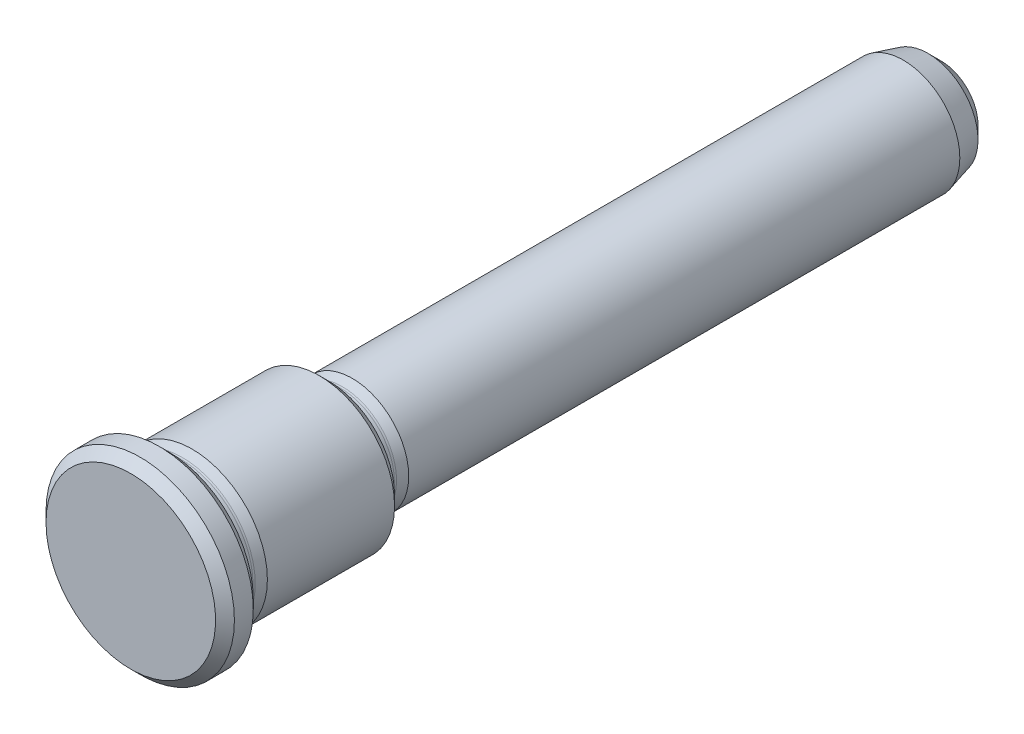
ISO-10303-21;
HEADER;
FILE_DESCRIPTION(('STEP AP214'),'2;1');
FILE_NAME('part.step','',(''),(''),'','','');
FILE_SCHEMA(('AUTOMOTIVE_DESIGN { 1 0 10303 214 1 1 1 1 }'));
ENDSEC;
DATA;
#1=APPLICATION_CONTEXT('core data for automotive mechanical design processes');
#2=APPLICATION_PROTOCOL_DEFINITION('international standard','automotive_design',2000,#1);
#3=PRODUCT_CONTEXT('',#1,'mechanical');
#4=PRODUCT('Part','Part','',(#3));
#5=PRODUCT_RELATED_PRODUCT_CATEGORY('part','',(#4));
#6=PRODUCT_DEFINITION_FORMATION('','',#4);
#7=PRODUCT_DEFINITION_CONTEXT('part definition',#1,'design');
#8=PRODUCT_DEFINITION('design','',#6,#7);
#9=PRODUCT_DEFINITION_SHAPE('','',#8);
#10=(LENGTH_UNIT() NAMED_UNIT(*) SI_UNIT(.MILLI.,.METRE.));
#11=(NAMED_UNIT(*) PLANE_ANGLE_UNIT() SI_UNIT($,.RADIAN.));
#12=(NAMED_UNIT(*) SI_UNIT($,.STERADIAN.) SOLID_ANGLE_UNIT());
#13=UNCERTAINTY_MEASURE_WITH_UNIT(LENGTH_MEASURE(1.E-05),#10,'distance_accuracy_value','');
#14=(GEOMETRIC_REPRESENTATION_CONTEXT(3) GLOBAL_UNCERTAINTY_ASSIGNED_CONTEXT((#13)) GLOBAL_UNIT_ASSIGNED_CONTEXT((#10,
#11,#12)) REPRESENTATION_CONTEXT('',''));
#15=CARTESIAN_POINT('',(0.,0.,0.));
#16=DIRECTION('',(0.,0.,1.));
#17=DIRECTION('',(1.,0.,0.));
#18=AXIS2_PLACEMENT_3D('',#15,#16,#17);
#19=CARTESIAN_POINT('',(0.,0.,0.));
#20=DIRECTION('',(0.,0.,-1.));
#21=DIRECTION('',(-1.,0.,0.));
#22=AXIS2_PLACEMENT_3D('',#19,#20,#21);
#23=PLANE('',#22);
#24=CARTESIAN_POINT('',(0.,0.,0.));
#25=DIRECTION('',(0.,0.,-1.));
#26=DIRECTION('',(-1.,0.,0.));
#27=AXIS2_PLACEMENT_3D('',#24,#25,#26);
#28=CIRCLE('',#27,9.);
#29=CARTESIAN_POINT('',(-9.,0.,0.));
#30=VERTEX_POINT('',#29);
#31=EDGE_CURVE('E8',#30,#30,#28,.F.);
#32=ORIENTED_EDGE('',*,*,#31,.T.);
#33=EDGE_LOOP('',(#32));
#34=FACE_BOUND('',#33,.T.);
#35=ADVANCED_FACE('F13',(#34),#23,.F.);
#36=CARTESIAN_POINT('',(0.,0.,0.));
#37=DIRECTION('',(0.,0.,1.));
#38=DIRECTION('',(1.,0.,0.));
#39=AXIS2_PLACEMENT_3D('',#36,#37,#38);
#40=CYLINDRICAL_SURFACE('',#39,10.);
#41=CARTESIAN_POINT('',(0.,0.,-3.));
#42=DIRECTION('',(0.,0.,1.));
#43=DIRECTION('',(1.,0.,0.));
#44=AXIS2_PLACEMENT_3D('',#41,#42,#43);
#45=CIRCLE('',#44,10.);
#46=CARTESIAN_POINT('',(10.,0.,-3.));
#47=VERTEX_POINT('',#46);
#48=EDGE_CURVE('E24',#47,#47,#45,.T.);
#49=ORIENTED_EDGE('',*,*,#48,.T.);
#50=EDGE_LOOP('',(#49));
#51=FACE_BOUND('',#50,.T.);
#52=CARTESIAN_POINT('',(0.,0.,-1.));
#53=DIRECTION('',(0.,0.,-1.));
#54=DIRECTION('',(-1.,0.,0.));
#55=AXIS2_PLACEMENT_3D('',#52,#53,#54);
#56=CIRCLE('',#55,10.);
#57=CARTESIAN_POINT('',(-10.,0.,-1.));
#58=VERTEX_POINT('',#57);
#59=EDGE_CURVE('E28',#58,#58,#56,.T.);
#60=ORIENTED_EDGE('',*,*,#59,.T.);
#61=EDGE_LOOP('',(#60));
#62=FACE_BOUND('',#61,.T.);
#63=ADVANCED_FACE('F99',(#51,#62),#40,.T.);
#64=CARTESIAN_POINT('',(0.,10.,-4.));
#65=DIRECTION('',(0.,0.,1.));
#66=DIRECTION('',(1.,0.,0.));
#67=AXIS2_PLACEMENT_3D('',#64,#65,#66);
#68=PLANE('',#67);
#69=CARTESIAN_POINT('',(0.,0.,-4.));
#70=DIRECTION('',(0.,0.,1.));
#71=DIRECTION('',(1.,0.,0.));
#72=AXIS2_PLACEMENT_3D('',#69,#70,#71);
#73=CIRCLE('',#72,9.);
#74=CARTESIAN_POINT('',(9.,0.,-4.));
#75=VERTEX_POINT('',#74);
#76=EDGE_CURVE('E20',#75,#75,#73,.F.);
#77=ORIENTED_EDGE('',*,*,#76,.T.);
#78=EDGE_LOOP('',(#77));
#79=FACE_BOUND('',#78,.T.);
#80=CARTESIAN_POINT('',(0.,0.,-4.));
#81=DIRECTION('',(0.,0.,1.));
#82=DIRECTION('',(1.,0.,0.));
#83=AXIS2_PLACEMENT_3D('',#80,#81,#82);
#84=CIRCLE('',#83,8.5);
#85=CARTESIAN_POINT('',(8.5,0.,-4.));
#86=VERTEX_POINT('',#85);
#87=EDGE_CURVE('E45',#86,#86,#84,.T.);
#88=ORIENTED_EDGE('',*,*,#87,.T.);
#89=EDGE_LOOP('',(#88));
#90=FACE_BOUND('',#89,.T.);
#91=ADVANCED_FACE('F105',(#79,#90),#68,.F.);
#92=CARTESIAN_POINT('',(0.,0.,-4.8));
#93=DIRECTION('',(0.,0.,1.));
#94=DIRECTION('',(1.,0.,0.));
#95=AXIS2_PLACEMENT_3D('',#92,#93,#94);
#96=TOROIDAL_SURFACE('',#95,8.5,0.8);
#97=ORIENTED_EDGE('',*,*,#87,.F.);
#98=EDGE_LOOP('',(#97));
#99=FACE_BOUND('',#98,.T.);
#100=CARTESIAN_POINT('',(0.,0.,-4.8));
#101=DIRECTION('',(0.,0.,1.));
#102=DIRECTION('',(1.,0.,0.));
#103=AXIS2_PLACEMENT_3D('',#100,#101,#102);
#104=CIRCLE('',#103,7.7);
#105=CARTESIAN_POINT('',(7.7,0.,-4.8));
#106=VERTEX_POINT('',#105);
#107=EDGE_CURVE('E48',#106,#106,#104,.T.);
#108=ORIENTED_EDGE('',*,*,#107,.T.);
#109=EDGE_LOOP('',(#108));
#110=FACE_BOUND('',#109,.T.);
#111=ADVANCED_FACE('F175',(#99,#110),#96,.F.);
#112=CARTESIAN_POINT('',(0.,0.,0.));
#113=DIRECTION('',(0.,0.,1.));
#114=DIRECTION('',(1.,0.,0.));
#115=AXIS2_PLACEMENT_3D('',#112,#113,#114);
#116=CYLINDRICAL_SURFACE('',#115,7.7);
#117=ORIENTED_EDGE('',*,*,#107,.F.);
#118=EDGE_LOOP('',(#117));
#119=FACE_BOUND('',#118,.T.);
#120=CARTESIAN_POINT('',(0.,0.,-5.27506275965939));
#121=DIRECTION('',(0.,0.,1.));
#122=DIRECTION('',(1.,0.,0.));
#123=AXIS2_PLACEMENT_3D('',#120,#121,#122);
#124=CIRCLE('',#123,7.7);
#125=CARTESIAN_POINT('',(7.7,0.,-5.27506275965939));
#126=VERTEX_POINT('',#125);
#127=EDGE_CURVE('E51',#126,#126,#124,.T.);
#128=ORIENTED_EDGE('',*,*,#127,.T.);
#129=EDGE_LOOP('',(#128));
#130=FACE_BOUND('',#129,.T.);
#131=ADVANCED_FACE('F231',(#119,#130),#116,.T.);
#132=CARTESIAN_POINT('',(0.,0.,-5.27506275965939));
#133=DIRECTION('',(0.,0.,1.));
#134=DIRECTION('',(1.,0.,0.));
#135=AXIS2_PLACEMENT_3D('',#132,#133,#134);
#136=TOROIDAL_SURFACE('',#135,8.5,0.8);
#137=ORIENTED_EDGE('',*,*,#127,.F.);
#138=EDGE_LOOP('',(#137));
#139=FACE_BOUND('',#138,.T.);
#140=CARTESIAN_POINT('',(0.,0.,-5.4821179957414));
#141=DIRECTION('',(0.,0.,1.));
#142=DIRECTION('',(1.,0.,0.));
#143=AXIS2_PLACEMENT_3D('',#140,#141,#142);
#144=CIRCLE('',#143,7.72725933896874);
#145=CARTESIAN_POINT('',(7.72725933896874,0.,-5.4821179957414));
#146=VERTEX_POINT('',#145);
#147=EDGE_CURVE('E54',#146,#146,#144,.T.);
#148=ORIENTED_EDGE('',*,*,#147,.T.);
#149=EDGE_LOOP('',(#148));
#150=FACE_BOUND('',#149,.T.);
#151=ADVANCED_FACE('F221',(#139,#150),#136,.F.);
#152=CARTESIAN_POINT('',(0.,0.,-6.5));
#153=DIRECTION('',(0.,0.,-1.));
#154=DIRECTION('',(-1.,0.,0.));
#155=AXIS2_PLACEMENT_3D('',#152,#153,#154);
#156=CONICAL_SURFACE('',#155,8.,0.261799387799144);
#157=ORIENTED_EDGE('',*,*,#147,.F.);
#158=EDGE_LOOP('',(#157));
#159=FACE_BOUND('',#158,.T.);
#160=CARTESIAN_POINT('',(0.,0.,-6.5));
#161=DIRECTION('',(0.,0.,1.));
#162=DIRECTION('',(1.,0.,0.));
#163=AXIS2_PLACEMENT_3D('',#160,#161,#162);
#164=CIRCLE('',#163,8.);
#165=CARTESIAN_POINT('',(8.,0.,-6.5));
#166=VERTEX_POINT('',#165);
#167=EDGE_CURVE('E57',#166,#166,#164,.T.);
#168=ORIENTED_EDGE('',*,*,#167,.T.);
#169=EDGE_LOOP('',(#168));
#170=FACE_BOUND('',#169,.T.);
#171=ADVANCED_FACE('F163',(#159,#170),#156,.T.);
#172=CARTESIAN_POINT('',(0.,0.,0.));
#173=DIRECTION('',(0.,0.,1.));
#174=DIRECTION('',(1.,0.,0.));
#175=AXIS2_PLACEMENT_3D('',#172,#173,#174);
#176=CYLINDRICAL_SURFACE('',#175,8.);
#177=CARTESIAN_POINT('',(0.,0.,-20.));
#178=DIRECTION('',(0.,0.,1.));
#179=DIRECTION('',(1.,0.,0.));
#180=AXIS2_PLACEMENT_3D('',#177,#178,#179);
#181=CIRCLE('',#180,8.);
#182=CARTESIAN_POINT('',(8.,0.,-20.));
#183=VERTEX_POINT('',#182);
#184=EDGE_CURVE('E36',#183,#183,#181,.T.);
#185=ORIENTED_EDGE('',*,*,#184,.T.);
#186=EDGE_LOOP('',(#185));
#187=FACE_BOUND('',#186,.T.);
#188=ORIENTED_EDGE('',*,*,#167,.F.);
#189=EDGE_LOOP('',(#188));
#190=FACE_BOUND('',#189,.T.);
#191=ADVANCED_FACE('F151',(#187,#190),#176,.T.);
#192=CARTESIAN_POINT('',(0.,8.,-21.));
#193=DIRECTION('',(0.,0.,1.));
#194=DIRECTION('',(1.,0.,0.));
#195=AXIS2_PLACEMENT_3D('',#192,#193,#194);
#196=PLANE('',#195);
#197=CARTESIAN_POINT('',(0.,0.,-21.));
#198=DIRECTION('',(0.,0.,1.));
#199=DIRECTION('',(1.,0.,0.));
#200=AXIS2_PLACEMENT_3D('',#197,#198,#199);
#201=CIRCLE('',#200,7.);
#202=CARTESIAN_POINT('',(7.,0.,-21.));
#203=VERTEX_POINT('',#202);
#204=EDGE_CURVE('E33',#203,#203,#201,.F.);
#205=ORIENTED_EDGE('',*,*,#204,.T.);
#206=EDGE_LOOP('',(#205));
#207=FACE_BOUND('',#206,.T.);
#208=CARTESIAN_POINT('',(0.,0.,-21.));
#209=DIRECTION('',(0.,0.,1.));
#210=DIRECTION('',(1.,0.,0.));
#211=AXIS2_PLACEMENT_3D('',#208,#209,#210);
#212=CIRCLE('',#211,6.5);
#213=CARTESIAN_POINT('',(6.5,0.,-21.));
#214=VERTEX_POINT('',#213);
#215=EDGE_CURVE('E60',#214,#214,#212,.T.);
#216=ORIENTED_EDGE('',*,*,#215,.T.);
#217=EDGE_LOOP('',(#216));
#218=FACE_BOUND('',#217,.T.);
#219=ADVANCED_FACE('F145',(#207,#218),#196,.F.);
#220=CARTESIAN_POINT('',(0.,0.,-21.8));
#221=DIRECTION('',(0.,0.,1.));
#222=DIRECTION('',(1.,0.,0.));
#223=AXIS2_PLACEMENT_3D('',#220,#221,#222);
#224=TOROIDAL_SURFACE('',#223,6.5,0.8);
#225=ORIENTED_EDGE('',*,*,#215,.F.);
#226=EDGE_LOOP('',(#225));
#227=FACE_BOUND('',#226,.T.);
#228=CARTESIAN_POINT('',(0.,0.,-21.8));
#229=DIRECTION('',(0.,0.,1.));
#230=DIRECTION('',(1.,0.,0.));
#231=AXIS2_PLACEMENT_3D('',#228,#229,#230);
#232=CIRCLE('',#231,5.7);
#233=CARTESIAN_POINT('',(5.7,0.,-21.8));
#234=VERTEX_POINT('',#233);
#235=EDGE_CURVE('E63',#234,#234,#232,.T.);
#236=ORIENTED_EDGE('',*,*,#235,.T.);
#237=EDGE_LOOP('',(#236));
#238=FACE_BOUND('',#237,.T.);
#239=ADVANCED_FACE('F150',(#227,#238),#224,.F.);
#240=CARTESIAN_POINT('',(0.,0.,0.));
#241=DIRECTION('',(0.,0.,1.));
#242=DIRECTION('',(1.,0.,0.));
#243=AXIS2_PLACEMENT_3D('',#240,#241,#242);
#244=CYLINDRICAL_SURFACE('',#243,5.7);
#245=ORIENTED_EDGE('',*,*,#235,.F.);
#246=EDGE_LOOP('',(#245));
#247=FACE_BOUND('',#246,.T.);
#248=CARTESIAN_POINT('',(0.,0.,-22.2750627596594));
#249=DIRECTION('',(0.,0.,1.));
#250=DIRECTION('',(1.,0.,0.));
#251=AXIS2_PLACEMENT_3D('',#248,#249,#250);
#252=CIRCLE('',#251,5.7);
#253=CARTESIAN_POINT('',(5.7,0.,-22.2750627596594));
#254=VERTEX_POINT('',#253);
#255=EDGE_CURVE('E66',#254,#254,#252,.T.);
#256=ORIENTED_EDGE('',*,*,#255,.T.);
#257=EDGE_LOOP('',(#256));
#258=FACE_BOUND('',#257,.T.);
#259=ADVANCED_FACE('F197',(#247,#258),#244,.T.);
#260=CARTESIAN_POINT('',(0.,0.,-22.2750627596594));
#261=DIRECTION('',(0.,0.,1.));
#262=DIRECTION('',(1.,0.,0.));
#263=AXIS2_PLACEMENT_3D('',#260,#261,#262);
#264=TOROIDAL_SURFACE('',#263,6.5,0.8);
#265=ORIENTED_EDGE('',*,*,#255,.F.);
#266=EDGE_LOOP('',(#265));
#267=FACE_BOUND('',#266,.T.);
#268=CARTESIAN_POINT('',(0.,0.,-22.4821179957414));
#269=DIRECTION('',(0.,0.,1.));
#270=DIRECTION('',(1.,0.,0.));
#271=AXIS2_PLACEMENT_3D('',#268,#269,#270);
#272=CIRCLE('',#271,5.72725933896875);
#273=CARTESIAN_POINT('',(5.72725933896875,0.,-22.4821179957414));
#274=VERTEX_POINT('',#273);
#275=EDGE_CURVE('E69',#274,#274,#272,.T.);
#276=ORIENTED_EDGE('',*,*,#275,.T.);
#277=EDGE_LOOP('',(#276));
#278=FACE_BOUND('',#277,.T.);
#279=ADVANCED_FACE('F186',(#267,#278),#264,.F.);
#280=CARTESIAN_POINT('',(0.,0.,-23.5));
#281=DIRECTION('',(0.,0.,-1.));
#282=DIRECTION('',(-1.,0.,0.));
#283=AXIS2_PLACEMENT_3D('',#280,#281,#282);
#284=CONICAL_SURFACE('',#283,6.,0.261799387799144);
#285=ORIENTED_EDGE('',*,*,#275,.F.);
#286=EDGE_LOOP('',(#285));
#287=FACE_BOUND('',#286,.T.);
#288=CARTESIAN_POINT('',(0.,0.,-23.5));
#289=DIRECTION('',(0.,0.,1.));
#290=DIRECTION('',(1.,0.,0.));
#291=AXIS2_PLACEMENT_3D('',#288,#289,#290);
#292=CIRCLE('',#291,6.);
#293=CARTESIAN_POINT('',(6.,0.,-23.5));
#294=VERTEX_POINT('',#293);
#295=EDGE_CURVE('E72',#294,#294,#292,.T.);
#296=ORIENTED_EDGE('',*,*,#295,.T.);
#297=EDGE_LOOP('',(#296));
#298=FACE_BOUND('',#297,.T.);
#299=ADVANCED_FACE('F95',(#287,#298),#284,.T.);
#300=CARTESIAN_POINT('',(0.,0.,0.));
#301=DIRECTION('',(0.,0.,1.));
#302=DIRECTION('',(1.,0.,0.));
#303=AXIS2_PLACEMENT_3D('',#300,#301,#302);
#304=CYLINDRICAL_SURFACE('',#303,6.);
#305=ORIENTED_EDGE('',*,*,#295,.F.);
#306=EDGE_LOOP('',(#305));
#307=FACE_BOUND('',#306,.T.);
#308=CARTESIAN_POINT('',(0.,0.,-82.));
#309=DIRECTION('',(0.,0.,1.));
#310=DIRECTION('',(1.,0.,0.));
#311=AXIS2_PLACEMENT_3D('',#308,#309,#310);
#312=CIRCLE('',#311,6.);
#313=CARTESIAN_POINT('',(6.,0.,-82.));
#314=VERTEX_POINT('',#313);
#315=EDGE_CURVE('E75',#314,#314,#312,.T.);
#316=ORIENTED_EDGE('',*,*,#315,.T.);
#317=EDGE_LOOP('',(#316));
#318=FACE_BOUND('',#317,.T.);
#319=ADVANCED_FACE('F79',(#307,#318),#304,.T.);
#320=CARTESIAN_POINT('',(0.,0.,-86.));
#321=DIRECTION('',(0.,0.,1.));
#322=DIRECTION('',(1.,0.,0.));
#323=AXIS2_PLACEMENT_3D('',#320,#321,#322);
#324=CONICAL_SURFACE('',#323,4.92820323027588,0.261799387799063);
#325=CARTESIAN_POINT('',(0.,0.,-84.6339745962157));
#326=DIRECTION('',(0.,0.,-1.));
#327=DIRECTION('',(-1.,0.,0.));
#328=AXIS2_PLACEMENT_3D('',#325,#326,#327);
#329=CIRCLE('',#328,5.29422863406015);
#330=CARTESIAN_POINT('',(-5.29422863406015,0.,-84.6339745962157));
#331=VERTEX_POINT('',#330);
#332=EDGE_CURVE('E42',#331,#331,#329,.F.);
#333=ORIENTED_EDGE('',*,*,#332,.T.);
#334=EDGE_LOOP('',(#333));
#335=FACE_BOUND('',#334,.T.);
#336=ORIENTED_EDGE('',*,*,#315,.F.);
#337=EDGE_LOOP('',(#336));
#338=FACE_BOUND('',#337,.T.);
#339=ADVANCED_FACE('F81',(#335,#338),#324,.T.);
#340=CARTESIAN_POINT('',(0.,4.92820323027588,-86.));
#341=DIRECTION('',(0.,0.,1.));
#342=DIRECTION('',(1.,0.,0.));
#343=AXIS2_PLACEMENT_3D('',#340,#341,#342);
#344=PLANE('',#343);
#345=CARTESIAN_POINT('',(0.,0.,-86.));
#346=DIRECTION('',(0.,0.,1.));
#347=DIRECTION('',(1.,0.,0.));
#348=AXIS2_PLACEMENT_3D('',#345,#346,#347);
#349=CIRCLE('',#348,3.92820323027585);
#350=CARTESIAN_POINT('',(3.92820323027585,0.,-86.));
#351=VERTEX_POINT('',#350);
#352=EDGE_CURVE('E39',#351,#351,#349,.F.);
#353=ORIENTED_EDGE('',*,*,#352,.T.);
#354=EDGE_LOOP('',(#353));
#355=FACE_BOUND('',#354,.T.);
#356=ADVANCED_FACE('F83',(#355),#344,.F.);
#357=CARTESIAN_POINT('',(0.,0.,-84.6339745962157));
#358=DIRECTION('',(0.,0.,1.));
#359=DIRECTION('',(1.,0.,0.));
#360=AXIS2_PLACEMENT_3D('',#357,#358,#359);
#361=CONICAL_SURFACE('',#360,5.29422863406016,0.785398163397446);
#362=ORIENTED_EDGE('',*,*,#352,.F.);
#363=EDGE_LOOP('',(#362));
#364=FACE_BOUND('',#363,.T.);
#365=ORIENTED_EDGE('',*,*,#332,.F.);
#366=EDGE_LOOP('',(#365));
#367=FACE_BOUND('',#366,.T.);
#368=ADVANCED_FACE('F92',(#364,#367),#361,.T.);
#369=CARTESIAN_POINT('',(0.,0.,-20.));
#370=DIRECTION('',(0.,0.,1.));
#371=DIRECTION('',(1.,0.,0.));
#372=AXIS2_PLACEMENT_3D('',#369,#370,#371);
#373=CONICAL_SURFACE('',#372,8.,0.785398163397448);
#374=ORIENTED_EDGE('',*,*,#204,.F.);
#375=EDGE_LOOP('',(#374));
#376=FACE_BOUND('',#375,.T.);
#377=ORIENTED_EDGE('',*,*,#184,.F.);
#378=EDGE_LOOP('',(#377));
#379=FACE_BOUND('',#378,.T.);
#380=ADVANCED_FACE('F112',(#376,#379),#373,.T.);
#381=CARTESIAN_POINT('',(0.,0.,-3.));
#382=DIRECTION('',(0.,0.,1.));
#383=DIRECTION('',(1.,0.,0.));
#384=AXIS2_PLACEMENT_3D('',#381,#382,#383);
#385=CONICAL_SURFACE('',#384,10.,0.785398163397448);
#386=ORIENTED_EDGE('',*,*,#76,.F.);
#387=EDGE_LOOP('',(#386));
#388=FACE_BOUND('',#387,.T.);
#389=ORIENTED_EDGE('',*,*,#48,.F.);
#390=EDGE_LOOP('',(#389));
#391=FACE_BOUND('',#390,.T.);
#392=ADVANCED_FACE('F115',(#388,#391),#385,.T.);
#393=CARTESIAN_POINT('',(0.,0.,0.));
#394=DIRECTION('',(0.,0.,-1.));
#395=DIRECTION('',(-1.,0.,0.));
#396=AXIS2_PLACEMENT_3D('',#393,#394,#395);
#397=CONICAL_SURFACE('',#396,9.,0.785398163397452);
#398=ORIENTED_EDGE('',*,*,#59,.F.);
#399=EDGE_LOOP('',(#398));
#400=FACE_BOUND('',#399,.T.);
#401=ORIENTED_EDGE('',*,*,#31,.F.);
#402=EDGE_LOOP('',(#401));
#403=FACE_BOUND('',#402,.T.);
#404=ADVANCED_FACE('F15',(#400,#403),#397,.T.);
#405=CLOSED_SHELL('',(#35,#63,#91,#111,#131,#151,#171,#191,#219,#239,#259,#279,#299,#319,#339,
#356,#368,#380,#392,#404));
#406=MANIFOLD_SOLID_BREP('B1',#405);
#407=ADVANCED_BREP_SHAPE_REPRESENTATION('',(#18,#406),#14);
#408=SHAPE_DEFINITION_REPRESENTATION(#9,#407);
ENDSEC;
END-ISO-10303-21;
